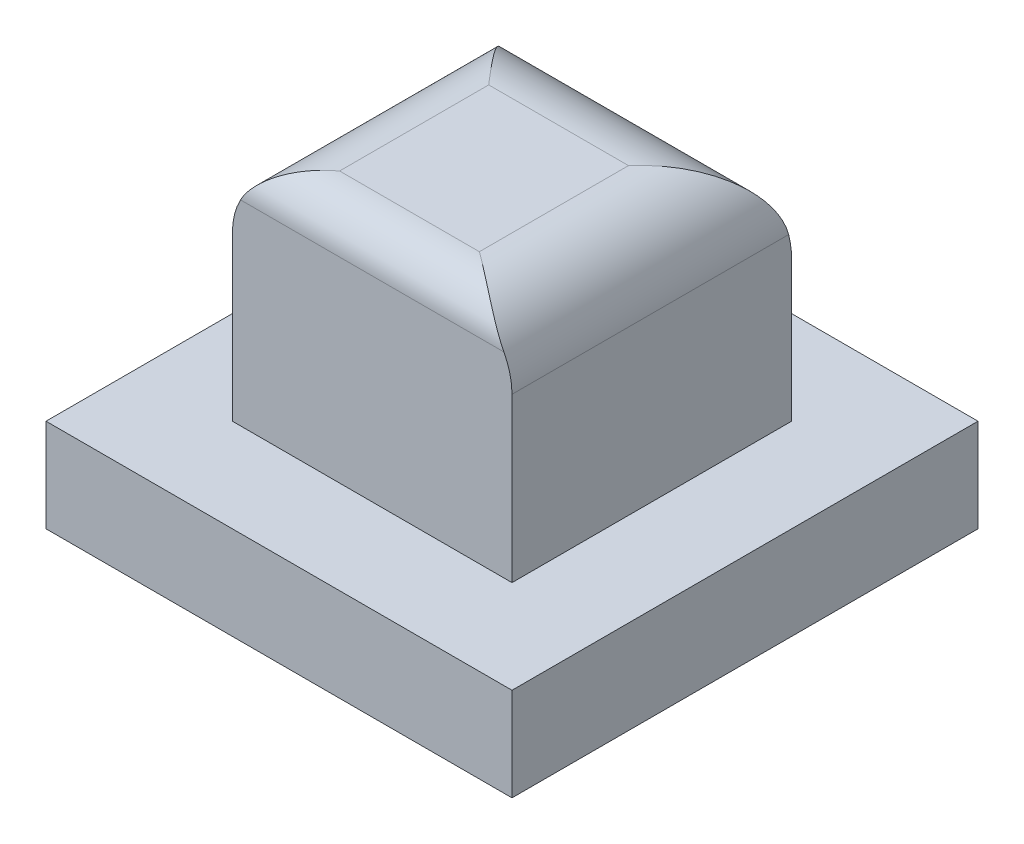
ISO-10303-21;
HEADER;
FILE_DESCRIPTION(('STEP AP214'),'2;1');
FILE_NAME('part.step','',(''),(''),'','','');
FILE_SCHEMA(('AUTOMOTIVE_DESIGN { 1 0 10303 214 1 1 1 1 }'));
ENDSEC;
DATA;
#1=APPLICATION_CONTEXT('core data for automotive mechanical design processes');
#2=APPLICATION_PROTOCOL_DEFINITION('international standard','automotive_design',2000,#1);
#3=PRODUCT_CONTEXT('',#1,'mechanical');
#4=PRODUCT('Part','Part','',(#3));
#5=PRODUCT_RELATED_PRODUCT_CATEGORY('part','',(#4));
#6=PRODUCT_DEFINITION_FORMATION('','',#4);
#7=PRODUCT_DEFINITION_CONTEXT('part definition',#1,'design');
#8=PRODUCT_DEFINITION('design','',#6,#7);
#9=PRODUCT_DEFINITION_SHAPE('','',#8);
#10=(LENGTH_UNIT() NAMED_UNIT(*) SI_UNIT(.MILLI.,.METRE.));
#11=(NAMED_UNIT(*) PLANE_ANGLE_UNIT() SI_UNIT($,.RADIAN.));
#12=(NAMED_UNIT(*) SI_UNIT($,.STERADIAN.) SOLID_ANGLE_UNIT());
#13=UNCERTAINTY_MEASURE_WITH_UNIT(LENGTH_MEASURE(1.E-05),#10,'distance_accuracy_value','');
#14=(GEOMETRIC_REPRESENTATION_CONTEXT(3) GLOBAL_UNCERTAINTY_ASSIGNED_CONTEXT((#13)) GLOBAL_UNIT_ASSIGNED_CONTEXT((#10,
#11,#12)) REPRESENTATION_CONTEXT('',''));
#15=CARTESIAN_POINT('',(0.,0.,0.));
#16=DIRECTION('',(0.,0.,1.));
#17=DIRECTION('',(1.,0.,0.));
#18=AXIS2_PLACEMENT_3D('',#15,#16,#17);
#19=CARTESIAN_POINT('',(-50.,20.,50.));
#20=DIRECTION('',(0.,-1.,0.));
#21=DIRECTION('',(1.,0.,0.));
#22=AXIS2_PLACEMENT_3D('',#19,#20,#21);
#23=PLANE('',#22);
#24=DIRECTION('',(-1.,0.,0.));
#25=VECTOR('',#24,1.);
#26=CARTESIAN_POINT('',(-50.,20.,-50.));
#27=LINE('',#26,#25);
#28=CARTESIAN_POINT('',(50.,20.,-50.));
#29=VERTEX_POINT('',#28);
#30=CARTESIAN_POINT('',(-50.,20.,-50.));
#31=VERTEX_POINT('',#30);
#32=EDGE_CURVE('E161',#29,#31,#27,.T.);
#33=ORIENTED_EDGE('',*,*,#32,.T.);
#34=DIRECTION('',(0.,0.,-1.));
#35=VECTOR('',#34,1.);
#36=CARTESIAN_POINT('',(-50.,20.,50.));
#37=LINE('',#36,#35);
#38=CARTESIAN_POINT('',(-50.,20.,50.));
#39=VERTEX_POINT('',#38);
#40=EDGE_CURVE('E167',#39,#31,#37,.T.);
#41=ORIENTED_EDGE('',*,*,#40,.F.);
#42=DIRECTION('',(-1.,0.,0.));
#43=VECTOR('',#42,1.);
#44=CARTESIAN_POINT('',(-50.,20.,50.));
#45=LINE('',#44,#43);
#46=CARTESIAN_POINT('',(50.,20.,50.));
#47=VERTEX_POINT('',#46);
#48=EDGE_CURVE('E165',#47,#39,#45,.T.);
#49=ORIENTED_EDGE('',*,*,#48,.F.);
#50=DIRECTION('',(0.,0.,-1.));
#51=VECTOR('',#50,1.);
#52=CARTESIAN_POINT('',(50.,20.,50.));
#53=LINE('',#52,#51);
#54=EDGE_CURVE('E177',#47,#29,#53,.T.);
#55=ORIENTED_EDGE('',*,*,#54,.T.);
#56=EDGE_LOOP('',(#33,#41,#49,#55));
#57=FACE_BOUND('',#56,.T.);
#58=DIRECTION('',(0.,0.,-1.));
#59=VECTOR('',#58,1.);
#60=CARTESIAN_POINT('',(30.,20.,30.));
#61=LINE('',#60,#59);
#62=CARTESIAN_POINT('',(30.,20.,30.));
#63=VERTEX_POINT('',#62);
#64=CARTESIAN_POINT('',(30.,20.,-30.));
#65=VERTEX_POINT('',#64);
#66=EDGE_CURVE('E129',#63,#65,#61,.T.);
#67=ORIENTED_EDGE('',*,*,#66,.F.);
#68=DIRECTION('',(1.,0.,0.));
#69=VECTOR('',#68,1.);
#70=CARTESIAN_POINT('',(30.,20.,30.));
#71=LINE('',#70,#69);
#72=CARTESIAN_POINT('',(-30.,20.,30.));
#73=VERTEX_POINT('',#72);
#74=EDGE_CURVE('E134',#73,#63,#71,.T.);
#75=ORIENTED_EDGE('',*,*,#74,.F.);
#76=DIRECTION('',(0.,0.,1.));
#77=VECTOR('',#76,1.);
#78=CARTESIAN_POINT('',(-30.,20.,30.));
#79=LINE('',#78,#77);
#80=CARTESIAN_POINT('',(-30.,20.,-30.));
#81=VERTEX_POINT('',#80);
#82=EDGE_CURVE('E146',#81,#73,#79,.T.);
#83=ORIENTED_EDGE('',*,*,#82,.F.);
#84=DIRECTION('',(-1.,0.,0.));
#85=VECTOR('',#84,1.);
#86=CARTESIAN_POINT('',(30.,20.,-30.));
#87=LINE('',#86,#85);
#88=EDGE_CURVE('E142',#65,#81,#87,.T.);
#89=ORIENTED_EDGE('',*,*,#88,.F.);
#90=EDGE_LOOP('',(#67,#75,#83,#89));
#91=FACE_BOUND('',#90,.T.);
#92=ADVANCED_FACE('F34',(#57,#91),#23,.F.);
#93=CARTESIAN_POINT('',(-50.,20.,50.));
#94=DIRECTION('',(1.,0.,0.));
#95=DIRECTION('',(0.,1.,0.));
#96=AXIS2_PLACEMENT_3D('',#93,#94,#95);
#97=PLANE('',#96);
#98=DIRECTION('',(0.,-1.,0.));
#99=VECTOR('',#98,1.);
#100=CARTESIAN_POINT('',(-50.,20.,-50.));
#101=LINE('',#100,#99);
#102=CARTESIAN_POINT('',(-50.,0.,-50.));
#103=VERTEX_POINT('',#102);
#104=EDGE_CURVE('E156',#31,#103,#101,.T.);
#105=ORIENTED_EDGE('',*,*,#104,.T.);
#106=DIRECTION('',(0.,0.,-1.));
#107=VECTOR('',#106,1.);
#108=CARTESIAN_POINT('',(-50.,0.,50.));
#109=LINE('',#108,#107);
#110=CARTESIAN_POINT('',(-50.,0.,50.));
#111=VERTEX_POINT('',#110);
#112=EDGE_CURVE('E183',#111,#103,#109,.T.);
#113=ORIENTED_EDGE('',*,*,#112,.F.);
#114=DIRECTION('',(0.,-1.,0.));
#115=VECTOR('',#114,1.);
#116=CARTESIAN_POINT('',(-50.,20.,50.));
#117=LINE('',#116,#115);
#118=EDGE_CURVE('E157',#39,#111,#117,.T.);
#119=ORIENTED_EDGE('',*,*,#118,.F.);
#120=ORIENTED_EDGE('',*,*,#40,.T.);
#121=EDGE_LOOP('',(#105,#113,#119,#120));
#122=FACE_BOUND('',#121,.T.);
#123=ADVANCED_FACE('F264',(#122),#97,.F.);
#124=CARTESIAN_POINT('',(-50.,0.,50.));
#125=DIRECTION('',(0.,1.,0.));
#126=DIRECTION('',(0.,0.,1.));
#127=AXIS2_PLACEMENT_3D('',#124,#125,#126);
#128=PLANE('',#127);
#129=DIRECTION('',(1.,0.,0.));
#130=VECTOR('',#129,1.);
#131=CARTESIAN_POINT('',(-50.,0.,-50.));
#132=LINE('',#131,#130);
#133=CARTESIAN_POINT('',(50.,0.,-50.));
#134=VERTEX_POINT('',#133);
#135=EDGE_CURVE('E170',#103,#134,#132,.T.);
#136=ORIENTED_EDGE('',*,*,#135,.T.);
#137=DIRECTION('',(0.,0.,-1.));
#138=VECTOR('',#137,1.);
#139=CARTESIAN_POINT('',(50.,0.,50.));
#140=LINE('',#139,#138);
#141=CARTESIAN_POINT('',(50.,0.,50.));
#142=VERTEX_POINT('',#141);
#143=EDGE_CURVE('E180',#142,#134,#140,.T.);
#144=ORIENTED_EDGE('',*,*,#143,.F.);
#145=DIRECTION('',(1.,0.,0.));
#146=VECTOR('',#145,1.);
#147=CARTESIAN_POINT('',(-50.,0.,50.));
#148=LINE('',#147,#146);
#149=EDGE_CURVE('E160',#111,#142,#148,.T.);
#150=ORIENTED_EDGE('',*,*,#149,.F.);
#151=ORIENTED_EDGE('',*,*,#112,.T.);
#152=EDGE_LOOP('',(#136,#144,#150,#151));
#153=FACE_BOUND('',#152,.T.);
#154=ADVANCED_FACE('F270',(#153),#128,.F.);
#155=CARTESIAN_POINT('',(50.,20.,50.));
#156=DIRECTION('',(-1.,0.,0.));
#157=DIRECTION('',(0.,0.,1.));
#158=AXIS2_PLACEMENT_3D('',#155,#156,#157);
#159=PLANE('',#158);
#160=DIRECTION('',(0.,1.,0.));
#161=VECTOR('',#160,1.);
#162=CARTESIAN_POINT('',(50.,20.,-50.));
#163=LINE('',#162,#161);
#164=EDGE_CURVE('E172',#134,#29,#163,.T.);
#165=ORIENTED_EDGE('',*,*,#164,.T.);
#166=ORIENTED_EDGE('',*,*,#54,.F.);
#167=DIRECTION('',(0.,1.,0.));
#168=VECTOR('',#167,1.);
#169=CARTESIAN_POINT('',(50.,20.,50.));
#170=LINE('',#169,#168);
#171=EDGE_CURVE('E163',#142,#47,#170,.T.);
#172=ORIENTED_EDGE('',*,*,#171,.F.);
#173=ORIENTED_EDGE('',*,*,#143,.T.);
#174=EDGE_LOOP('',(#165,#166,#172,#173));
#175=FACE_BOUND('',#174,.T.);
#176=ADVANCED_FACE('F276',(#175),#159,.F.);
#177=CARTESIAN_POINT('',(-50.,20.,50.));
#178=DIRECTION('',(0.,0.,1.));
#179=DIRECTION('',(1.,0.,0.));
#180=AXIS2_PLACEMENT_3D('',#177,#178,#179);
#181=PLANE('',#180);
#182=ORIENTED_EDGE('',*,*,#118,.T.);
#183=ORIENTED_EDGE('',*,*,#149,.T.);
#184=ORIENTED_EDGE('',*,*,#171,.T.);
#185=ORIENTED_EDGE('',*,*,#48,.T.);
#186=EDGE_LOOP('',(#182,#183,#184,#185));
#187=FACE_BOUND('',#186,.T.);
#188=ADVANCED_FACE('F279',(#187),#181,.T.);
#189=CARTESIAN_POINT('',(-50.,20.,-50.));
#190=DIRECTION('',(0.,0.,1.));
#191=DIRECTION('',(1.,0.,0.));
#192=AXIS2_PLACEMENT_3D('',#189,#190,#191);
#193=PLANE('',#192);
#194=ORIENTED_EDGE('',*,*,#104,.F.);
#195=ORIENTED_EDGE('',*,*,#32,.F.);
#196=ORIENTED_EDGE('',*,*,#164,.F.);
#197=ORIENTED_EDGE('',*,*,#135,.F.);
#198=EDGE_LOOP('',(#194,#195,#196,#197));
#199=FACE_BOUND('',#198,.T.);
#200=ADVANCED_FACE('F274',(#199),#193,.F.);
#201=CARTESIAN_POINT('',(30.,70.,30.));
#202=DIRECTION('',(-1.,0.,0.));
#203=DIRECTION('',(0.,-1.,0.));
#204=AXIS2_PLACEMENT_3D('',#201,#202,#203);
#205=PLANE('',#204);
#206=DIRECTION('',(0.,-1.,0.));
#207=VECTOR('',#206,1.);
#208=CARTESIAN_POINT('',(30.,70.,-30.));
#209=LINE('',#208,#207);
#210=CARTESIAN_POINT('',(30.,50.,-30.));
#211=VERTEX_POINT('',#210);
#212=EDGE_CURVE('E154',#211,#65,#209,.T.);
#213=ORIENTED_EDGE('',*,*,#212,.F.);
#214=CARTESIAN_POINT('',(30.,50.,-10.));
#215=DIRECTION('',(-1.,0.,0.));
#216=DIRECTION('',(0.,-1.,0.));
#217=AXIS2_PLACEMENT_3D('',#214,#215,#216);
#218=CIRCLE('',#217,20.);
#219=CARTESIAN_POINT('',(30.,55.,-29.3649167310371));
#220=VERTEX_POINT('',#219);
#221=EDGE_CURVE('E203',#211,#220,#218,.F.);
#222=ORIENTED_EDGE('',*,*,#221,.T.);
#223=DIRECTION('',(0.,0.,-1.));
#224=VECTOR('',#223,1.);
#225=CARTESIAN_POINT('',(30.,55.,30.));
#226=LINE('',#225,#224);
#227=CARTESIAN_POINT('',(30.,55.,30.));
#228=VERTEX_POINT('',#227);
#229=EDGE_CURVE('E131',#220,#228,#226,.F.);
#230=ORIENTED_EDGE('',*,*,#229,.T.);
#231=DIRECTION('',(0.,-1.,0.));
#232=VECTOR('',#231,1.);
#233=CARTESIAN_POINT('',(30.,70.,30.));
#234=LINE('',#233,#232);
#235=EDGE_CURVE('E125',#228,#63,#234,.T.);
#236=ORIENTED_EDGE('',*,*,#235,.T.);
#237=ORIENTED_EDGE('',*,*,#66,.T.);
#238=EDGE_LOOP('',(#213,#222,#230,#236,#237));
#239=FACE_BOUND('',#238,.T.);
#240=ADVANCED_FACE('F128',(#239),#205,.F.);
#241=CARTESIAN_POINT('',(30.,70.,-30.));
#242=DIRECTION('',(0.,0.,1.));
#243=DIRECTION('',(1.,0.,0.));
#244=AXIS2_PLACEMENT_3D('',#241,#242,#243);
#245=PLANE('',#244);
#246=DIRECTION('',(0.,-1.,0.));
#247=VECTOR('',#246,1.);
#248=CARTESIAN_POINT('',(-30.,70.,-30.));
#249=LINE('',#248,#247);
#250=CARTESIAN_POINT('',(-30.,50.,-30.));
#251=VERTEX_POINT('',#250);
#252=EDGE_CURVE('E152',#251,#81,#249,.T.);
#253=ORIENTED_EDGE('',*,*,#252,.F.);
#254=DIRECTION('',(-1.,0.,0.));
#255=VECTOR('',#254,1.);
#256=CARTESIAN_POINT('',(30.,50.,-30.));
#257=LINE('',#256,#255);
#258=EDGE_CURVE('E199',#251,#211,#257,.F.);
#259=ORIENTED_EDGE('',*,*,#258,.T.);
#260=ORIENTED_EDGE('',*,*,#212,.T.);
#261=ORIENTED_EDGE('',*,*,#88,.T.);
#262=EDGE_LOOP('',(#253,#259,#260,#261));
#263=FACE_BOUND('',#262,.T.);
#264=ADVANCED_FACE('F252',(#263),#245,.F.);
#265=CARTESIAN_POINT('',(-30.,70.,30.));
#266=DIRECTION('',(1.,0.,0.));
#267=DIRECTION('',(0.,1.,0.));
#268=AXIS2_PLACEMENT_3D('',#265,#266,#267);
#269=PLANE('',#268);
#270=DIRECTION('',(0.,0.,1.));
#271=VECTOR('',#270,1.);
#272=CARTESIAN_POINT('',(-30.,55.,-30.));
#273=LINE('',#272,#271);
#274=CARTESIAN_POINT('',(-30.,55.,30.));
#275=VERTEX_POINT('',#274);
#276=CARTESIAN_POINT('',(-30.,55.,-29.3649167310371));
#277=VERTEX_POINT('',#276);
#278=EDGE_CURVE('E195',#275,#277,#273,.F.);
#279=ORIENTED_EDGE('',*,*,#278,.T.);
#280=CARTESIAN_POINT('',(-30.,50.,-10.));
#281=DIRECTION('',(1.,0.,0.));
#282=DIRECTION('',(0.,1.,0.));
#283=AXIS2_PLACEMENT_3D('',#280,#281,#282);
#284=CIRCLE('',#283,20.);
#285=EDGE_CURVE('E197',#277,#251,#284,.F.);
#286=ORIENTED_EDGE('',*,*,#285,.T.);
#287=ORIENTED_EDGE('',*,*,#252,.T.);
#288=ORIENTED_EDGE('',*,*,#82,.T.);
#289=DIRECTION('',(0.,-1.,0.));
#290=VECTOR('',#289,1.);
#291=CARTESIAN_POINT('',(-30.,70.,30.));
#292=LINE('',#291,#290);
#293=EDGE_CURVE('E133',#275,#73,#292,.T.);
#294=ORIENTED_EDGE('',*,*,#293,.F.);
#295=EDGE_LOOP('',(#279,#286,#287,#288,#294));
#296=FACE_BOUND('',#295,.T.);
#297=ADVANCED_FACE('F249',(#296),#269,.F.);
#298=CARTESIAN_POINT('',(30.,70.,30.));
#299=DIRECTION('',(0.,0.,-1.));
#300=DIRECTION('',(-1.,0.,0.));
#301=AXIS2_PLACEMENT_3D('',#298,#299,#300);
#302=PLANE('',#301);
#303=DIRECTION('',(1.,0.,0.));
#304=VECTOR('',#303,1.);
#305=CARTESIAN_POINT('',(-30.,62.,30.));
#306=LINE('',#305,#304);
#307=CARTESIAN_POINT('',(28.2664991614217,62.,30.));
#308=VERTEX_POINT('',#307);
#309=CARTESIAN_POINT('',(-28.2664991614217,62.,30.));
#310=VERTEX_POINT('',#309);
#311=EDGE_CURVE('E54',#308,#310,#306,.F.);
#312=ORIENTED_EDGE('',*,*,#311,.T.);
#313=CARTESIAN_POINT('',(-15.,55.,30.));
#314=DIRECTION('',(0.,0.,-1.));
#315=DIRECTION('',(-1.,0.,0.));
#316=AXIS2_PLACEMENT_3D('',#313,#314,#315);
#317=CIRCLE('',#316,15.);
#318=EDGE_CURVE('E12',#310,#275,#317,.F.);
#319=ORIENTED_EDGE('',*,*,#318,.T.);
#320=ORIENTED_EDGE('',*,*,#293,.T.);
#321=ORIENTED_EDGE('',*,*,#74,.T.);
#322=ORIENTED_EDGE('',*,*,#235,.F.);
#323=CARTESIAN_POINT('',(15.,55.,30.));
#324=DIRECTION('',(0.,0.,-1.));
#325=DIRECTION('',(-1.,0.,0.));
#326=AXIS2_PLACEMENT_3D('',#323,#324,#325);
#327=CIRCLE('',#326,15.);
#328=EDGE_CURVE('E47',#228,#308,#327,.F.);
#329=ORIENTED_EDGE('',*,*,#328,.T.);
#330=EDGE_LOOP('',(#312,#319,#320,#321,#322,#329));
#331=FACE_BOUND('',#330,.T.);
#332=ADVANCED_FACE('F144',(#331),#302,.F.);
#333=CARTESIAN_POINT('',(30.,70.,-30.));
#334=DIRECTION('',(0.,1.,0.));
#335=DIRECTION('',(-1.,0.,0.));
#336=AXIS2_PLACEMENT_3D('',#333,#334,#335);
#337=PLANE('',#336);
#338=DIRECTION('',(0.,0.,-1.));
#339=VECTOR('',#338,1.);
#340=CARTESIAN_POINT('',(15.,70.,-30.));
#341=LINE('',#340,#339);
#342=CARTESIAN_POINT('',(15.,70.,22.));
#343=VERTEX_POINT('',#342);
#344=CARTESIAN_POINT('',(15.,70.,-10.));
#345=VERTEX_POINT('',#344);
#346=EDGE_CURVE('E188',#343,#345,#341,.T.);
#347=ORIENTED_EDGE('',*,*,#346,.T.);
#348=DIRECTION('',(-1.,0.,0.));
#349=VECTOR('',#348,1.);
#350=CARTESIAN_POINT('',(-30.,70.,-10.));
#351=LINE('',#350,#349);
#352=CARTESIAN_POINT('',(-15.,70.,-10.));
#353=VERTEX_POINT('',#352);
#354=EDGE_CURVE('E192',#345,#353,#351,.T.);
#355=ORIENTED_EDGE('',*,*,#354,.T.);
#356=DIRECTION('',(0.,0.,1.));
#357=VECTOR('',#356,1.);
#358=CARTESIAN_POINT('',(-15.,70.,30.));
#359=LINE('',#358,#357);
#360=CARTESIAN_POINT('',(-15.,70.,22.));
#361=VERTEX_POINT('',#360);
#362=EDGE_CURVE('E190',#353,#361,#359,.T.);
#363=ORIENTED_EDGE('',*,*,#362,.T.);
#364=DIRECTION('',(1.,0.,0.));
#365=VECTOR('',#364,1.);
#366=CARTESIAN_POINT('',(30.,70.,22.));
#367=LINE('',#366,#365);
#368=EDGE_CURVE('E186',#361,#343,#367,.T.);
#369=ORIENTED_EDGE('',*,*,#368,.T.);
#370=EDGE_LOOP('',(#347,#355,#363,#369));
#371=FACE_BOUND('',#370,.T.);
#372=ADVANCED_FACE('F255',(#371),#337,.T.);
#373=CARTESIAN_POINT('',(30.,62.,22.));
#374=DIRECTION('',(-1.,0.,0.));
#375=DIRECTION('',(0.,-1.,0.));
#376=AXIS2_PLACEMENT_3D('',#373,#374,#375);
#377=CYLINDRICAL_SURFACE('',#376,8.);
#378=CARTESIAN_POINT('',(-28.2664991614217,62.,30.));
#379=CARTESIAN_POINT('',(-28.200557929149,62.1249783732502,30.0000001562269));
#380=CARTESIAN_POINT('',(-28.1328596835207,62.2489955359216,29.9970711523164));
#381=CARTESIAN_POINT('',(-27.9941190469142,62.4948500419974,29.9856286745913));
#382=CARTESIAN_POINT('',(-27.9230773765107,62.6166878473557,29.9771163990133));
#383=CARTESIAN_POINT('',(-27.7054264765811,62.9781642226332,29.9436560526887));
#384=CARTESIAN_POINT('',(-27.5540377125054,63.2142459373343,29.910782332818));
#385=CARTESIAN_POINT('',(-27.2416606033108,63.6728305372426,29.8265870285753));
#386=CARTESIAN_POINT('',(-27.0807862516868,63.8954475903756,29.7754575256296));
#387=CARTESIAN_POINT('',(-26.7493068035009,64.3288950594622,29.6568115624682));
#388=CARTESIAN_POINT('',(-26.5786963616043,64.5397188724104,29.589286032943));
#389=CARTESIAN_POINT('',(-26.1767276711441,65.0101443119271,29.4174882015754));
#390=CARTESIAN_POINT('',(-25.9424682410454,65.2654645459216,29.3082663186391));
#391=CARTESIAN_POINT('',(-25.4621946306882,65.7545356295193,29.0694802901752));
#392=CARTESIAN_POINT('',(-25.2161784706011,65.9882828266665,28.939912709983));
#393=CARTESIAN_POINT('',(-24.7131984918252,66.4353639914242,28.6631081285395));
#394=CARTESIAN_POINT('',(-24.4561864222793,66.6485909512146,28.5157866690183));
#395=CARTESIAN_POINT('',(-23.9341031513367,67.0536715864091,28.2068742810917));
#396=CARTESIAN_POINT('',(-23.6690314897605,67.2455240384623,28.0452825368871));
#397=CARTESIAN_POINT('',(-23.0230664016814,67.6821959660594,27.6421055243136));
#398=CARTESIAN_POINT('',(-22.6388977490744,67.9168389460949,27.3947073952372));
#399=CARTESIAN_POINT('',(-21.8605316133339,68.3465680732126,26.8819091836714));
#400=CARTESIAN_POINT('',(-21.4663299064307,68.5416372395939,26.616501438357));
#401=CARTESIAN_POINT('',(-20.6706173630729,68.8936413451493,26.0721859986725));
#402=CARTESIAN_POINT('',(-20.2691093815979,69.0505908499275,25.7932835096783));
#403=CARTESIAN_POINT('',(-19.4607708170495,69.3277359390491,25.2255282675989));
#404=CARTESIAN_POINT('',(-19.0539416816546,69.4479413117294,24.9366781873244));
#405=CARTESIAN_POINT('',(-18.0458431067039,69.7005023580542,24.2155628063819));
#406=CARTESIAN_POINT('',(-17.4423239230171,69.8124091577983,23.7792011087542));
#407=CARTESIAN_POINT('',(-16.232335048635,69.9616883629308,22.8999495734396));
#408=CARTESIAN_POINT('',(-15.6258721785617,69.9991880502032,22.4570721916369));
#409=CARTESIAN_POINT('',(-15.0131875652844,69.999995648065,22.0096308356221));
#410=CARTESIAN_POINT('',(-15.0065937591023,69.9999999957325,22.00481540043));
#411=CARTESIAN_POINT('',(-15.,70.,22.));
#412=B_SPLINE_CURVE_WITH_KNOTS('',3,(#378,#379,#380,#381,#382,#383,#384,#385,#386,#387,#388,
#389,#390,#391,#392,#393,#394,#395,#396,#397,#398,#399,#400,#401,#402,#403,#404,#405,#406,#407,
#408,#409,#410,#411),.UNSPECIFIED.,.F.,.F.,(4,2,2,2,2,2,2,2,2,2,2,2,2,2,2,2,4),(0.,
0.423824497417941,0.847558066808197,1.69340273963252,2.53059798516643,3.36825737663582,
4.45657294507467,5.54507243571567,6.6389712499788,7.73293264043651,9.27164731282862,
10.8110208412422,12.3498052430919,13.888179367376,16.1435528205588,18.3950648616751,
18.4195597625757),.UNSPECIFIED.);
#413=EDGE_CURVE('E228',#310,#361,#412,.T.);
#414=ORIENTED_EDGE('',*,*,#413,.F.);
#415=ORIENTED_EDGE('',*,*,#311,.F.);
#416=CARTESIAN_POINT('',(28.2664991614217,62.,30.));
#417=CARTESIAN_POINT('',(28.2005579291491,62.1249783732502,30.0000001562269));
#418=CARTESIAN_POINT('',(28.1328596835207,62.2489955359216,29.9970711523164));
#419=CARTESIAN_POINT('',(27.9941190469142,62.4948500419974,29.9856286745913));
#420=CARTESIAN_POINT('',(27.9230773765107,62.6166878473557,29.9771163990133));
#421=CARTESIAN_POINT('',(27.7054264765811,62.9781642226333,29.9436560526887));
#422=CARTESIAN_POINT('',(27.5540377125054,63.2142459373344,29.910782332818));
#423=CARTESIAN_POINT('',(27.2416606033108,63.6728305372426,29.8265870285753));
#424=CARTESIAN_POINT('',(27.0807862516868,63.8954475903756,29.7754575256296));
#425=CARTESIAN_POINT('',(26.7493068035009,64.3288950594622,29.6568115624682));
#426=CARTESIAN_POINT('',(26.5786963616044,64.5397188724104,29.589286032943));
#427=CARTESIAN_POINT('',(26.1767276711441,65.0101443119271,29.4174882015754));
#428=CARTESIAN_POINT('',(25.9424682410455,65.2654645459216,29.3082663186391));
#429=CARTESIAN_POINT('',(25.4621946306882,65.7545356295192,29.0694802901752));
#430=CARTESIAN_POINT('',(25.2161784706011,65.9882828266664,28.939912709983));
#431=CARTESIAN_POINT('',(24.7131984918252,66.4353639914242,28.6631081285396));
#432=CARTESIAN_POINT('',(24.4561864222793,66.6485909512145,28.5157866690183));
#433=CARTESIAN_POINT('',(23.9341031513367,67.0536715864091,28.2068742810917));
#434=CARTESIAN_POINT('',(23.6690314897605,67.2455240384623,28.0452825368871));
#435=CARTESIAN_POINT('',(23.0230664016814,67.6821959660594,27.6421055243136));
#436=CARTESIAN_POINT('',(22.6388977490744,67.9168389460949,27.3947073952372));
#437=CARTESIAN_POINT('',(21.8605316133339,68.3465680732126,26.8819091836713));
#438=CARTESIAN_POINT('',(21.4663299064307,68.541637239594,26.616501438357));
#439=CARTESIAN_POINT('',(20.6706173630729,68.8936413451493,26.0721859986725));
#440=CARTESIAN_POINT('',(20.2691093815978,69.0505908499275,25.7932835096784));
#441=CARTESIAN_POINT('',(19.4607708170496,69.3277359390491,25.2255282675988));
#442=CARTESIAN_POINT('',(19.0539416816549,69.4479413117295,24.936678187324));
#443=CARTESIAN_POINT('',(18.0458431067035,69.7005023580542,24.2155628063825));
#444=CARTESIAN_POINT('',(17.4423239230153,69.8124091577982,23.7792011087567));
#445=CARTESIAN_POINT('',(16.2323350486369,69.9616883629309,22.899949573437));
#446=CARTESIAN_POINT('',(15.6258721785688,69.9991880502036,22.4570721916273));
#447=CARTESIAN_POINT('',(15.0131875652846,69.999995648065,22.0096308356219));
#448=CARTESIAN_POINT('',(15.0065937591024,69.9999999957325,22.0048154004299));
#449=CARTESIAN_POINT('',(15.,70.,22.));
#450=B_SPLINE_CURVE_WITH_KNOTS('',3,(#416,#417,#418,#419,#420,#421,#422,#423,#424,#425,#426,
#427,#428,#429,#430,#431,#432,#433,#434,#435,#436,#437,#438,#439,#440,#441,#442,#443,#444,#445,
#446,#447,#448,#449),.UNSPECIFIED.,.F.,.F.,(4,2,2,2,2,2,2,2,2,2,2,2,2,2,2,2,4),(0.,
0.423824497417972,0.847558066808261,1.69340273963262,2.5305979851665,3.36825737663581,
4.45657294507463,5.5450724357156,6.63897124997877,7.73293264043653,9.27164731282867,
10.8110208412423,12.349805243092,13.8881793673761,16.1435528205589,18.3950648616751,
18.4195597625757),.UNSPECIFIED.);
#451=EDGE_CURVE('E39',#343,#308,#450,.F.);
#452=ORIENTED_EDGE('',*,*,#451,.F.);
#453=ORIENTED_EDGE('',*,*,#368,.F.);
#454=EDGE_LOOP('',(#414,#415,#452,#453));
#455=FACE_BOUND('',#454,.T.);
#456=ADVANCED_FACE('F36',(#455),#377,.T.);
#457=CARTESIAN_POINT('',(15.,55.,-30.));
#458=DIRECTION('',(0.,0.,1.));
#459=DIRECTION('',(1.,0.,0.));
#460=AXIS2_PLACEMENT_3D('',#457,#458,#459);
#461=CYLINDRICAL_SURFACE('',#460,15.);
#462=ORIENTED_EDGE('',*,*,#328,.F.);
#463=ORIENTED_EDGE('',*,*,#229,.F.);
#464=CARTESIAN_POINT('',(30.,55.,-29.3649167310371));
#465=CARTESIAN_POINT('',(30.0000023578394,55.1992445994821,-29.3134757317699));
#466=CARTESIAN_POINT('',(29.9960293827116,55.3976558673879,-29.2589614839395));
#467=CARTESIAN_POINT('',(29.9803575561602,55.7923971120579,-29.143938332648));
#468=CARTESIAN_POINT('',(29.9686597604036,55.9887273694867,-29.0834302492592));
#469=CARTESIAN_POINT('',(29.9223607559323,56.5734728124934,-28.8933102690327));
#470=CARTESIAN_POINT('',(29.8765525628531,56.9582406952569,-28.7549479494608));
#471=CARTESIAN_POINT('',(29.7578147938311,57.7112648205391,-28.4580285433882));
#472=CARTESIAN_POINT('',(29.6851398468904,58.0796408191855,-28.2996699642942));
#473=CARTESIAN_POINT('',(29.5150003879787,58.8016243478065,-27.963574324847));
#474=CARTESIAN_POINT('',(29.4175285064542,59.1552274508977,-27.7858315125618));
#475=CARTESIAN_POINT('',(29.2008265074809,59.8442036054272,-27.4139074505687));
#476=CARTESIAN_POINT('',(29.0817094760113,60.1796601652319,-27.2198143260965));
#477=CARTESIAN_POINT('',(28.8237756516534,60.8332368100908,-26.8163158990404));
#478=CARTESIAN_POINT('',(28.6849607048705,61.1513585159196,-26.6069120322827));
#479=CARTESIAN_POINT('',(28.3894890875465,61.7704900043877,-26.1740101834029));
#480=CARTESIAN_POINT('',(28.2327893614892,62.0714557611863,-25.9504787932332));
#481=CARTESIAN_POINT('',(27.9038676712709,62.6552261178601,-25.4913914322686));
#482=CARTESIAN_POINT('',(27.7316420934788,62.9380264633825,-25.2558326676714));
#483=CARTESIAN_POINT('',(27.2722515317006,63.6402584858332,-24.6379333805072));
#484=CARTESIAN_POINT('',(26.9751647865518,64.0465174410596,-24.2479177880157));
#485=CARTESIAN_POINT('',(26.3537188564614,64.8151682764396,-23.4469029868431));
#486=CARTESIAN_POINT('',(26.0293476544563,65.1775406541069,-23.0358945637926));
#487=CARTESIAN_POINT('',(25.3578351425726,65.8602447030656,-22.1961461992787));
#488=CARTESIAN_POINT('',(25.010650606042,66.1804928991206,-21.7673732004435));
#489=CARTESIAN_POINT('',(24.2983544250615,66.7795228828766,-20.8961957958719));
#490=CARTESIAN_POINT('',(23.9332434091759,67.0583061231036,-20.4537918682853));
#491=CARTESIAN_POINT('',(23.0532381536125,67.6699494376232,-19.3952286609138));
#492=CARTESIAN_POINT('',(22.5321044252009,67.9856767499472,-18.7743188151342));
#493=CARTESIAN_POINT('',(21.4699930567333,68.5462147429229,-17.5174246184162));
#494=CARTESIAN_POINT('',(20.929006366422,68.7909926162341,-16.8814334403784));
#495=CARTESIAN_POINT('',(19.8338195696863,69.2118925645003,-15.5997811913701));
#496=CARTESIAN_POINT('',(19.2796365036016,69.3880985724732,-14.9541329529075));
#497=CARTESIAN_POINT('',(18.1625040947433,69.6741543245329,-13.6563489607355));
#498=CARTESIAN_POINT('',(17.5995594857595,69.7840387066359,-13.0042167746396));
#499=CARTESIAN_POINT('',(16.6993359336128,69.9072652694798,-11.96290986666));
#500=CARTESIAN_POINT('',(16.3635290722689,69.9416999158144,-11.5748134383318));
#501=CARTESIAN_POINT('',(15.6913054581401,69.9878449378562,-10.7982537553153));
#502=CARTESIAN_POINT('',(15.3548894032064,69.9995733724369,-10.4097910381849));
#503=CARTESIAN_POINT('',(15.0123442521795,69.9999961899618,-10.014253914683));
#504=CARTESIAN_POINT('',(15.006172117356,69.9999999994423,-10.0071269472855));
#505=CARTESIAN_POINT('',(15.,70.,-10.));
#506=B_SPLINE_CURVE_WITH_KNOTS('',3,(#464,#465,#466,#467,#468,#469,#470,#471,#472,#473,#474,
#475,#476,#477,#478,#479,#480,#481,#482,#483,#484,#485,#486,#487,#488,#489,#490,#491,#492,#493,
#494,#495,#496,#497,#498,#499,#500,#501,#502,#503,#504,#505),.UNSPECIFIED.,.F.,.F.,(4,2,2,2,2,2,
2,2,2,2,2,2,2,2,2,2,2,2,2,2,4),(0.,0.617199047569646,1.23431376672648,2.46669784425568,
3.68768956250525,4.90904457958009,6.12419303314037,7.33922767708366,8.55725165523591,
9.77555986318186,11.6828276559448,13.5909399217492,15.5027781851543,17.4145494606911,
20.0206501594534,22.6279540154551,25.2320563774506,27.8347975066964,29.3774759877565,
30.9189270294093,30.9472113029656),.UNSPECIFIED.);
#507=EDGE_CURVE('E214',#345,#220,#506,.F.);
#508=ORIENTED_EDGE('',*,*,#507,.F.);
#509=ORIENTED_EDGE('',*,*,#346,.F.);
#510=ORIENTED_EDGE('',*,*,#451,.T.);
#511=EDGE_LOOP('',(#462,#463,#508,#509,#510));
#512=FACE_BOUND('',#511,.T.);
#513=ADVANCED_FACE('F224',(#512),#461,.T.);
#514=CARTESIAN_POINT('',(-15.,55.,-30.));
#515=DIRECTION('',(0.,0.,-1.));
#516=DIRECTION('',(-1.,0.,0.));
#517=AXIS2_PLACEMENT_3D('',#514,#515,#516);
#518=CYLINDRICAL_SURFACE('',#517,15.);
#519=ORIENTED_EDGE('',*,*,#413,.T.);
#520=ORIENTED_EDGE('',*,*,#362,.F.);
#521=CARTESIAN_POINT('',(-30.,55.,-29.3649167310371));
#522=CARTESIAN_POINT('',(-30.0000023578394,55.1992445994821,-29.3134757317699));
#523=CARTESIAN_POINT('',(-29.9960293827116,55.3976558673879,-29.2589614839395));
#524=CARTESIAN_POINT('',(-29.9803575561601,55.7923971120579,-29.143938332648));
#525=CARTESIAN_POINT('',(-29.9686597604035,55.9887273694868,-29.0834302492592));
#526=CARTESIAN_POINT('',(-29.9223607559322,56.5734728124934,-28.8933102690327));
#527=CARTESIAN_POINT('',(-29.8765525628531,56.9582406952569,-28.7549479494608));
#528=CARTESIAN_POINT('',(-29.757814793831,57.7112648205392,-28.4580285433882));
#529=CARTESIAN_POINT('',(-29.6851398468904,58.0796408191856,-28.2996699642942));
#530=CARTESIAN_POINT('',(-29.5150003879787,58.8016243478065,-27.963574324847));
#531=CARTESIAN_POINT('',(-29.4175285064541,59.1552274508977,-27.7858315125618));
#532=CARTESIAN_POINT('',(-29.2008265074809,59.8442036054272,-27.4139074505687));
#533=CARTESIAN_POINT('',(-29.0817094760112,60.179660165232,-27.2198143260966));
#534=CARTESIAN_POINT('',(-28.8237756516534,60.8332368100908,-26.8163158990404));
#535=CARTESIAN_POINT('',(-28.6849607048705,61.1513585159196,-26.6069120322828));
#536=CARTESIAN_POINT('',(-28.3894890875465,61.7704900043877,-26.1740101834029));
#537=CARTESIAN_POINT('',(-28.2327893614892,62.0714557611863,-25.9504787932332));
#538=CARTESIAN_POINT('',(-27.9038676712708,62.6552261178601,-25.4913914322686));
#539=CARTESIAN_POINT('',(-27.7316420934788,62.9380264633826,-25.2558326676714));
#540=CARTESIAN_POINT('',(-27.2722515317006,63.6402584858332,-24.6379333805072));
#541=CARTESIAN_POINT('',(-26.9751647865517,64.0465174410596,-24.2479177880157));
#542=CARTESIAN_POINT('',(-26.3537188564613,64.8151682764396,-23.446902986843));
#543=CARTESIAN_POINT('',(-26.0293476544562,65.1775406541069,-23.0358945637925));
#544=CARTESIAN_POINT('',(-25.3578351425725,65.8602447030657,-22.1961461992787));
#545=CARTESIAN_POINT('',(-25.010650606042,66.1804928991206,-21.7673732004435));
#546=CARTESIAN_POINT('',(-24.2983544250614,66.7795228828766,-20.8961957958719));
#547=CARTESIAN_POINT('',(-23.9332434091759,67.0583061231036,-20.4537918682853));
#548=CARTESIAN_POINT('',(-23.0532381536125,67.6699494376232,-19.3952286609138));
#549=CARTESIAN_POINT('',(-22.5321044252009,67.9856767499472,-18.7743188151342));
#550=CARTESIAN_POINT('',(-21.4699930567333,68.5462147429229,-17.5174246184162));
#551=CARTESIAN_POINT('',(-20.9290063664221,68.7909926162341,-16.8814334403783));
#552=CARTESIAN_POINT('',(-19.8338195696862,69.2118925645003,-15.5997811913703));
#553=CARTESIAN_POINT('',(-19.2796365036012,69.3880985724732,-14.954132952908));
#554=CARTESIAN_POINT('',(-18.1625040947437,69.6741543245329,-13.6563489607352));
#555=CARTESIAN_POINT('',(-17.599559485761,69.7840387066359,-13.0042167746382));
#556=CARTESIAN_POINT('',(-16.6993359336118,69.9072652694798,-11.9629098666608));
#557=CARTESIAN_POINT('',(-16.363529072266,69.9416999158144,-11.5748134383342));
#558=CARTESIAN_POINT('',(-15.6913054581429,69.9878449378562,-10.7982537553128));
#559=CARTESIAN_POINT('',(-15.3548894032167,69.9995733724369,-10.4097910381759));
#560=CARTESIAN_POINT('',(-15.0123442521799,69.9999961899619,-10.0142539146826));
#561=CARTESIAN_POINT('',(-15.0061721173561,69.9999999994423,-10.0071269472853));
#562=CARTESIAN_POINT('',(-15.,70.,-10.));
#563=B_SPLINE_CURVE_WITH_KNOTS('',3,(#521,#522,#523,#524,#525,#526,#527,#528,#529,#530,#531,
#532,#533,#534,#535,#536,#537,#538,#539,#540,#541,#542,#543,#544,#545,#546,#547,#548,#549,#550,
#551,#552,#553,#554,#555,#556,#557,#558,#559,#560,#561,#562),.UNSPECIFIED.,.F.,.F.,(4,2,2,2,2,2,
2,2,2,2,2,2,2,2,2,2,2,2,2,2,4),(0.,0.617199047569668,1.23431376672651,2.46669784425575,
3.68768956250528,4.9090445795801,6.12419303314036,7.33922767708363,8.5572516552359,
9.77555986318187,11.6828276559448,13.5909399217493,15.5027781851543,17.4145494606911,
20.0206501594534,22.627954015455,25.2320563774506,27.8347975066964,29.3774759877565,
30.9189270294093,30.9472113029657),.UNSPECIFIED.);
#564=EDGE_CURVE('E207',#277,#353,#563,.T.);
#565=ORIENTED_EDGE('',*,*,#564,.F.);
#566=ORIENTED_EDGE('',*,*,#278,.F.);
#567=ORIENTED_EDGE('',*,*,#318,.F.);
#568=EDGE_LOOP('',(#519,#520,#565,#566,#567));
#569=FACE_BOUND('',#568,.T.);
#570=ADVANCED_FACE('F221',(#569),#518,.T.);
#571=CARTESIAN_POINT('',(30.,50.,-10.));
#572=DIRECTION('',(1.,0.,0.));
#573=DIRECTION('',(0.,1.,0.));
#574=AXIS2_PLACEMENT_3D('',#571,#572,#573);
#575=CYLINDRICAL_SURFACE('',#574,20.);
#576=ORIENTED_EDGE('',*,*,#221,.F.);
#577=ORIENTED_EDGE('',*,*,#258,.F.);
#578=ORIENTED_EDGE('',*,*,#285,.F.);
#579=ORIENTED_EDGE('',*,*,#564,.T.);
#580=ORIENTED_EDGE('',*,*,#354,.F.);
#581=ORIENTED_EDGE('',*,*,#507,.T.);
#582=EDGE_LOOP('',(#576,#577,#578,#579,#580,#581));
#583=FACE_BOUND('',#582,.T.);
#584=ADVANCED_FACE('F218',(#583),#575,.T.);
#585=CLOSED_SHELL('',(#92,#123,#154,#176,#188,#200,#240,#264,#297,#332,#372,#456,#513,#570,#584));
#586=MANIFOLD_SOLID_BREP('B2',#585);
#587=ADVANCED_BREP_SHAPE_REPRESENTATION('',(#18,#586),#14);
#588=SHAPE_DEFINITION_REPRESENTATION(#9,#587);
ENDSEC;
END-ISO-10303-21;
